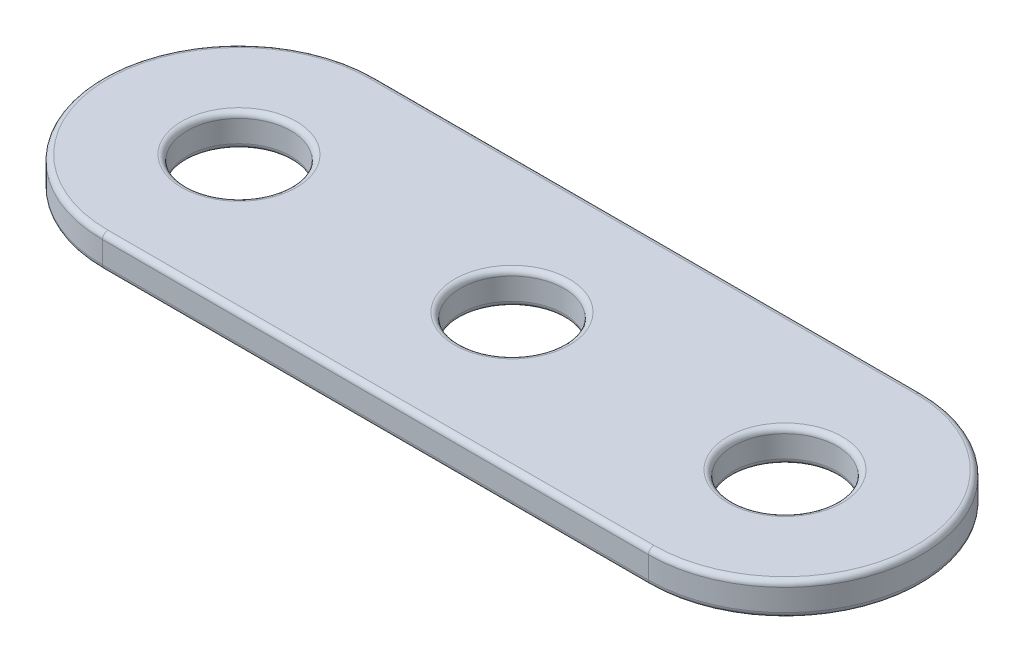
from build123d import *

# Parameters (mm, degrees)
EXTRUDE1_DEPTH     = 1.524
SKETCH2_R          = 2.413
CUT_EXTRUDE1_DEPTH = 35.229739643
LPATTERN1_COUNT    = 3
LPATTERN1_PITCH    = 12.7
FILLET1_R          = 0.254


with BuildPart() as part:
    # Sketch1 → Extrude1 (new body)
    with BuildSketch(Plane(origin=(0, 0, 0), x_dir=(1, 0, 0), z_dir=(0, 1, 0))):
        with BuildLine():
            Line((0, 0), (25.4, 0))
            ThreePointArc((25.4, 0), (31.75, 6.35), (25.4, 12.7))
            Line((25.4, 12.7), (0, 12.7))
            ThreePointArc((0, 12.7), (-6.35, 6.35), (0, 0))
        make_face()
    extrude(amount=EXTRUDE1_DEPTH)

    # Sketch2 → Cut-Extrude1 (cut, through all)
    with BuildSketch(Plane(origin=(0, 1.524, 0), x_dir=(-1, 0, 0), z_dir=(0, 1, 0))):
        with Locations(Location((0, -6.35, 0), (0, 0, 90))):
            Circle(SKETCH2_R)
    cut_extrude1 = extrude(amount=-CUT_EXTRUDE1_DEPTH, mode=Mode.SUBTRACT)

    # LPattern1: Cut-Extrude1 ×3
    with Locations(*[(i * LPATTERN1_PITCH, 0, 0) for i in range(1, LPATTERN1_COUNT)]):
        add(cut_extrude1, mode=Mode.SUBTRACT)

    # Fillet1
    fillet1_edges = [part.edges().sort_by_distance(p)[0] for p in [
        (31.75, 1.524, -6.35),
        (12.7, 1.524, -12.7),
        (0, 0, -8.763),
        (0, 1.524, -8.763),
        (12.7, 0, -8.763),
        (12.7, 1.524, -8.763),
        (25.4, 0, -8.763),
        (25.4, 1.524, -8.763),
        (-6.35, 1.524, -6.35),
        (12.7, 0, -12.7),
        (31.75, 0, -6.35),
        (12.7, 0, 0),
        (-6.35, 0, -6.35),
        (12.7, 1.524, 0),
    ]]
    fillet(fillet1_edges, radius=FILLET1_R)


solid = part.part
